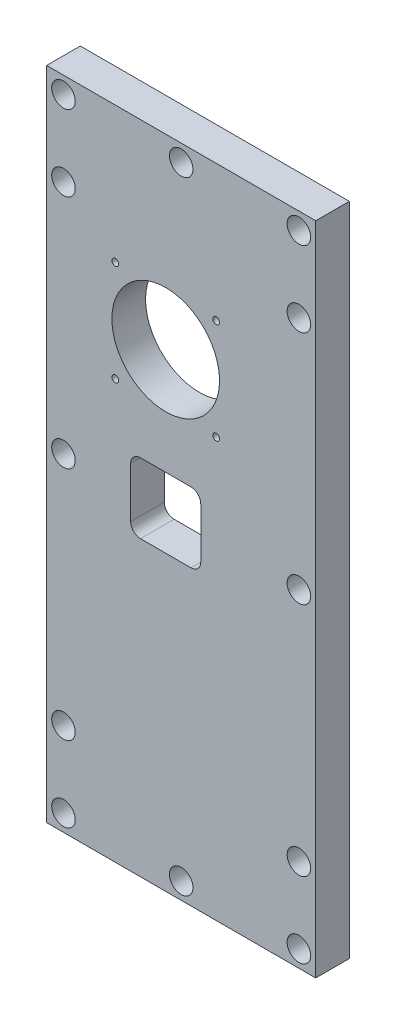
ISO-10303-21;
HEADER;
FILE_DESCRIPTION(('STEP AP214'),'2;1');
FILE_NAME('part.step','',(''),(''),'','','');
FILE_SCHEMA(('AUTOMOTIVE_DESIGN { 1 0 10303 214 1 1 1 1 }'));
ENDSEC;
DATA;
#1=APPLICATION_CONTEXT('core data for automotive mechanical design processes');
#2=APPLICATION_PROTOCOL_DEFINITION('international standard','automotive_design',2000,#1);
#3=PRODUCT_CONTEXT('',#1,'mechanical');
#4=PRODUCT('Part','Part','',(#3));
#5=PRODUCT_RELATED_PRODUCT_CATEGORY('part','',(#4));
#6=PRODUCT_DEFINITION_FORMATION('','',#4);
#7=PRODUCT_DEFINITION_CONTEXT('part definition',#1,'design');
#8=PRODUCT_DEFINITION('design','',#6,#7);
#9=PRODUCT_DEFINITION_SHAPE('','',#8);
#10=(LENGTH_UNIT() NAMED_UNIT(*) SI_UNIT(.MILLI.,.METRE.));
#11=(NAMED_UNIT(*) PLANE_ANGLE_UNIT() SI_UNIT($,.RADIAN.));
#12=(NAMED_UNIT(*) SI_UNIT($,.STERADIAN.) SOLID_ANGLE_UNIT());
#13=UNCERTAINTY_MEASURE_WITH_UNIT(LENGTH_MEASURE(1.E-05),#10,'distance_accuracy_value','');
#14=(GEOMETRIC_REPRESENTATION_CONTEXT(3) GLOBAL_UNCERTAINTY_ASSIGNED_CONTEXT((#13)) GLOBAL_UNIT_ASSIGNED_CONTEXT((#10,
#11,#12)) REPRESENTATION_CONTEXT('',''));
#15=CARTESIAN_POINT('',(0.,0.,0.));
#16=DIRECTION('',(0.,0.,1.));
#17=DIRECTION('',(1.,0.,0.));
#18=AXIS2_PLACEMENT_3D('',#15,#16,#17);
#19=CARTESIAN_POINT('',(-69.0593853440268,70.0995316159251,-10.));
#20=DIRECTION('',(-1.,0.,0.));
#21=DIRECTION('',(0.,0.,1.));
#22=AXIS2_PLACEMENT_3D('',#19,#20,#21);
#23=PLANE('',#22);
#24=DIRECTION('',(0.,-1.,0.));
#25=VECTOR('',#24,1.);
#26=CARTESIAN_POINT('',(-69.0593853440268,70.0995316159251,0.));
#27=LINE('',#26,#25);
#28=CARTESIAN_POINT('',(-69.0593853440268,70.0995316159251,0.));
#29=VERTEX_POINT('',#28);
#30=CARTESIAN_POINT('',(-69.0593853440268,-124.900468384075,0.));
#31=VERTEX_POINT('',#30);
#32=EDGE_CURVE('E183',#29,#31,#27,.T.);
#33=ORIENTED_EDGE('',*,*,#32,.F.);
#34=DIRECTION('',(0.,0.,1.));
#35=VECTOR('',#34,1.);
#36=CARTESIAN_POINT('',(-69.0593853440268,70.0995316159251,-10.));
#37=LINE('',#36,#35);
#38=CARTESIAN_POINT('',(-69.0593853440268,70.0995316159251,-10.));
#39=VERTEX_POINT('',#38);
#40=EDGE_CURVE('E11',#39,#29,#37,.T.);
#41=ORIENTED_EDGE('',*,*,#40,.F.);
#42=DIRECTION('',(0.,-1.,0.));
#43=VECTOR('',#42,1.);
#44=CARTESIAN_POINT('',(-69.0593853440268,70.0995316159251,-10.));
#45=LINE('',#44,#43);
#46=CARTESIAN_POINT('',(-69.0593853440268,-124.900468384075,-10.));
#47=VERTEX_POINT('',#46);
#48=EDGE_CURVE('E224',#39,#47,#45,.T.);
#49=ORIENTED_EDGE('',*,*,#48,.T.);
#50=DIRECTION('',(0.,0.,1.));
#51=VECTOR('',#50,1.);
#52=CARTESIAN_POINT('',(-69.0593853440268,-124.900468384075,-10.));
#53=LINE('',#52,#51);
#54=EDGE_CURVE('E36',#47,#31,#53,.T.);
#55=ORIENTED_EDGE('',*,*,#54,.T.);
#56=EDGE_LOOP('',(#33,#41,#49,#55));
#57=FACE_BOUND('',#56,.T.);
#58=ADVANCED_FACE('F33',(#57),#23,.T.);
#59=CARTESIAN_POINT('',(-69.0593853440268,70.0995316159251,-10.));
#60=DIRECTION('',(0.,1.,0.));
#61=DIRECTION('',(0.,0.,1.));
#62=AXIS2_PLACEMENT_3D('',#59,#60,#61);
#63=PLANE('',#62);
#64=DIRECTION('',(-1.,0.,0.));
#65=VECTOR('',#64,1.);
#66=CARTESIAN_POINT('',(-69.0593853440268,70.0995316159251,0.));
#67=LINE('',#66,#65);
#68=CARTESIAN_POINT('',(10.9406146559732,70.0995316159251,0.));
#69=VERTEX_POINT('',#68);
#70=EDGE_CURVE('E228',#69,#29,#67,.T.);
#71=ORIENTED_EDGE('',*,*,#70,.F.);
#72=DIRECTION('',(0.,0.,1.));
#73=VECTOR('',#72,1.);
#74=CARTESIAN_POINT('',(10.9406146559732,70.0995316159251,-10.));
#75=LINE('',#74,#73);
#76=CARTESIAN_POINT('',(10.9406146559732,70.0995316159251,-10.));
#77=VERTEX_POINT('',#76);
#78=EDGE_CURVE('E41',#77,#69,#75,.T.);
#79=ORIENTED_EDGE('',*,*,#78,.F.);
#80=DIRECTION('',(-1.,0.,0.));
#81=VECTOR('',#80,1.);
#82=CARTESIAN_POINT('',(-69.0593853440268,70.0995316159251,-10.));
#83=LINE('',#82,#81);
#84=EDGE_CURVE('E234',#77,#39,#83,.T.);
#85=ORIENTED_EDGE('',*,*,#84,.T.);
#86=ORIENTED_EDGE('',*,*,#40,.T.);
#87=EDGE_LOOP('',(#71,#79,#85,#86));
#88=FACE_BOUND('',#87,.T.);
#89=ADVANCED_FACE('F259',(#88),#63,.T.);
#90=CARTESIAN_POINT('',(10.9406146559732,70.0995316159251,-10.));
#91=DIRECTION('',(1.,0.,0.));
#92=DIRECTION('',(0.,1.,0.));
#93=AXIS2_PLACEMENT_3D('',#90,#91,#92);
#94=PLANE('',#93);
#95=DIRECTION('',(0.,1.,0.));
#96=VECTOR('',#95,1.);
#97=CARTESIAN_POINT('',(10.9406146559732,70.0995316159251,0.));
#98=LINE('',#97,#96);
#99=CARTESIAN_POINT('',(10.9406146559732,-124.900468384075,0.));
#100=VERTEX_POINT('',#99);
#101=EDGE_CURVE('E242',#100,#69,#98,.T.);
#102=ORIENTED_EDGE('',*,*,#101,.F.);
#103=DIRECTION('',(0.,0.,1.));
#104=VECTOR('',#103,1.);
#105=CARTESIAN_POINT('',(10.9406146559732,-124.900468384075,-10.));
#106=LINE('',#105,#104);
#107=CARTESIAN_POINT('',(10.9406146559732,-124.900468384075,-10.));
#108=VERTEX_POINT('',#107);
#109=EDGE_CURVE('E247',#108,#100,#106,.T.);
#110=ORIENTED_EDGE('',*,*,#109,.F.);
#111=DIRECTION('',(0.,1.,0.));
#112=VECTOR('',#111,1.);
#113=CARTESIAN_POINT('',(10.9406146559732,70.0995316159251,-10.));
#114=LINE('',#113,#112);
#115=EDGE_CURVE('E231',#108,#77,#114,.T.);
#116=ORIENTED_EDGE('',*,*,#115,.T.);
#117=ORIENTED_EDGE('',*,*,#78,.T.);
#118=EDGE_LOOP('',(#102,#110,#116,#117));
#119=FACE_BOUND('',#118,.T.);
#120=ADVANCED_FACE('F265',(#119),#94,.T.);
#121=CARTESIAN_POINT('',(-69.0593853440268,-124.900468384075,-10.));
#122=DIRECTION('',(0.,-1.,0.));
#123=DIRECTION('',(1.,0.,0.));
#124=AXIS2_PLACEMENT_3D('',#121,#122,#123);
#125=PLANE('',#124);
#126=DIRECTION('',(1.,0.,0.));
#127=VECTOR('',#126,1.);
#128=CARTESIAN_POINT('',(-69.0593853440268,-124.900468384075,0.));
#129=LINE('',#128,#127);
#130=EDGE_CURVE('E239',#31,#100,#129,.T.);
#131=ORIENTED_EDGE('',*,*,#130,.F.);
#132=ORIENTED_EDGE('',*,*,#54,.F.);
#133=DIRECTION('',(1.,0.,0.));
#134=VECTOR('',#133,1.);
#135=CARTESIAN_POINT('',(-69.0593853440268,-124.900468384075,-10.));
#136=LINE('',#135,#134);
#137=EDGE_CURVE('E227',#47,#108,#136,.T.);
#138=ORIENTED_EDGE('',*,*,#137,.T.);
#139=ORIENTED_EDGE('',*,*,#109,.T.);
#140=EDGE_LOOP('',(#131,#132,#138,#139));
#141=FACE_BOUND('',#140,.T.);
#142=ADVANCED_FACE('F255',(#141),#125,.T.);
#143=CARTESIAN_POINT('',(0.,0.,-10.));
#144=DIRECTION('',(0.,0.,1.));
#145=DIRECTION('',(1.,0.,0.));
#146=AXIS2_PLACEMENT_3D('',#143,#144,#145);
#147=PLANE('',#146);
#148=CARTESIAN_POINT('',(-64.0593853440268,65.0995316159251,-10.));
#149=DIRECTION('',(0.,0.,-1.));
#150=DIRECTION('',(-1.,0.,0.));
#151=AXIS2_PLACEMENT_3D('',#148,#149,#150);
#152=CIRCLE('',#151,1.7);
#153=CARTESIAN_POINT('',(-65.7593853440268,65.0995316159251,-10.));
#154=VERTEX_POINT('',#153);
#155=EDGE_CURVE('E869',#154,#154,#152,.T.);
#156=ORIENTED_EDGE('',*,*,#155,.F.);
#157=EDGE_LOOP('',(#156));
#158=FACE_BOUND('',#157,.T.);
#159=CARTESIAN_POINT('',(-29.0593853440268,65.099531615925,-10.));
#160=DIRECTION('',(0.,0.,-1.));
#161=DIRECTION('',(-1.,0.,0.));
#162=AXIS2_PLACEMENT_3D('',#159,#160,#161);
#163=CIRCLE('',#162,1.7);
#164=CARTESIAN_POINT('',(-30.7593853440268,65.099531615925,-10.));
#165=VERTEX_POINT('',#164);
#166=EDGE_CURVE('E872',#165,#165,#163,.T.);
#167=ORIENTED_EDGE('',*,*,#166,.F.);
#168=EDGE_LOOP('',(#167));
#169=FACE_BOUND('',#168,.T.);
#170=CARTESIAN_POINT('',(-64.0593853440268,42.5995316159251,-10.));
#171=DIRECTION('',(0.,0.,-1.));
#172=DIRECTION('',(-1.,0.,0.));
#173=AXIS2_PLACEMENT_3D('',#170,#171,#172);
#174=CIRCLE('',#173,1.7);
#175=CARTESIAN_POINT('',(-65.7593853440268,42.5995316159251,-10.));
#176=VERTEX_POINT('',#175);
#177=EDGE_CURVE('E878',#176,#176,#174,.T.);
#178=ORIENTED_EDGE('',*,*,#177,.F.);
#179=EDGE_LOOP('',(#178));
#180=FACE_BOUND('',#179,.T.);
#181=CARTESIAN_POINT('',(-64.0593853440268,-27.4004683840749,-10.));
#182=DIRECTION('',(0.,0.,-1.));
#183=DIRECTION('',(-1.,0.,0.));
#184=AXIS2_PLACEMENT_3D('',#181,#182,#183);
#185=CIRCLE('',#184,1.7);
#186=CARTESIAN_POINT('',(-65.7593853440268,-27.4004683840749,-10.));
#187=VERTEX_POINT('',#186);
#188=EDGE_CURVE('E884',#187,#187,#185,.T.);
#189=ORIENTED_EDGE('',*,*,#188,.F.);
#190=EDGE_LOOP('',(#189));
#191=FACE_BOUND('',#190,.T.);
#192=CARTESIAN_POINT('',(-64.0593853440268,-97.4004683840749,-10.));
#193=DIRECTION('',(0.,0.,-1.));
#194=DIRECTION('',(-1.,0.,0.));
#195=AXIS2_PLACEMENT_3D('',#192,#193,#194);
#196=CIRCLE('',#195,1.7);
#197=CARTESIAN_POINT('',(-65.7593853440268,-97.4004683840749,-10.));
#198=VERTEX_POINT('',#197);
#199=EDGE_CURVE('E890',#198,#198,#196,.T.);
#200=ORIENTED_EDGE('',*,*,#199,.F.);
#201=EDGE_LOOP('',(#200));
#202=FACE_BOUND('',#201,.T.);
#203=CARTESIAN_POINT('',(-64.0593853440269,-119.900468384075,-10.));
#204=DIRECTION('',(0.,0.,-1.));
#205=DIRECTION('',(-1.,0.,0.));
#206=AXIS2_PLACEMENT_3D('',#203,#204,#205);
#207=CIRCLE('',#206,1.7);
#208=CARTESIAN_POINT('',(-65.7593853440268,-119.900468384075,-10.));
#209=VERTEX_POINT('',#208);
#210=EDGE_CURVE('E896',#209,#209,#207,.T.);
#211=ORIENTED_EDGE('',*,*,#210,.F.);
#212=EDGE_LOOP('',(#211));
#213=FACE_BOUND('',#212,.T.);
#214=CARTESIAN_POINT('',(-29.0593853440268,-119.900468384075,-10.));
#215=DIRECTION('',(0.,0.,-1.));
#216=DIRECTION('',(-1.,0.,0.));
#217=AXIS2_PLACEMENT_3D('',#214,#215,#216);
#218=CIRCLE('',#217,1.7);
#219=CARTESIAN_POINT('',(-30.7593853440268,-119.900468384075,-10.));
#220=VERTEX_POINT('',#219);
#221=EDGE_CURVE('E902',#220,#220,#218,.T.);
#222=ORIENTED_EDGE('',*,*,#221,.F.);
#223=EDGE_LOOP('',(#222));
#224=FACE_BOUND('',#223,.T.);
#225=CARTESIAN_POINT('',(5.94061465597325,-119.900468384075,-10.));
#226=DIRECTION('',(0.,0.,-1.));
#227=DIRECTION('',(-1.,0.,0.));
#228=AXIS2_PLACEMENT_3D('',#225,#226,#227);
#229=CIRCLE('',#228,1.7);
#230=CARTESIAN_POINT('',(4.24061465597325,-119.900468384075,-10.));
#231=VERTEX_POINT('',#230);
#232=EDGE_CURVE('E853',#231,#231,#229,.T.);
#233=ORIENTED_EDGE('',*,*,#232,.F.);
#234=EDGE_LOOP('',(#233));
#235=FACE_BOUND('',#234,.T.);
#236=CARTESIAN_POINT('',(5.94061465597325,-97.400468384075,-10.));
#237=DIRECTION('',(0.,0.,-1.));
#238=DIRECTION('',(-1.,0.,0.));
#239=AXIS2_PLACEMENT_3D('',#236,#237,#238);
#240=CIRCLE('',#239,1.7);
#241=CARTESIAN_POINT('',(4.24061465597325,-97.400468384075,-10.));
#242=VERTEX_POINT('',#241);
#243=EDGE_CURVE('E850',#242,#242,#240,.T.);
#244=ORIENTED_EDGE('',*,*,#243,.F.);
#245=EDGE_LOOP('',(#244));
#246=FACE_BOUND('',#245,.T.);
#247=CARTESIAN_POINT('',(5.94061465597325,-27.400468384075,-10.));
#248=DIRECTION('',(0.,0.,-1.));
#249=DIRECTION('',(-1.,0.,0.));
#250=AXIS2_PLACEMENT_3D('',#247,#248,#249);
#251=CIRCLE('',#250,1.7);
#252=CARTESIAN_POINT('',(4.24061465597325,-27.400468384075,-10.));
#253=VERTEX_POINT('',#252);
#254=EDGE_CURVE('E854',#253,#253,#251,.T.);
#255=ORIENTED_EDGE('',*,*,#254,.F.);
#256=EDGE_LOOP('',(#255));
#257=FACE_BOUND('',#256,.T.);
#258=CARTESIAN_POINT('',(5.94061465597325,42.5995316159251,-10.));
#259=DIRECTION('',(0.,0.,-1.));
#260=DIRECTION('',(-1.,0.,0.));
#261=AXIS2_PLACEMENT_3D('',#258,#259,#260);
#262=CIRCLE('',#261,1.7);
#263=CARTESIAN_POINT('',(4.24061465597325,42.5995316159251,-10.));
#264=VERTEX_POINT('',#263);
#265=EDGE_CURVE('E860',#264,#264,#262,.T.);
#266=ORIENTED_EDGE('',*,*,#265,.F.);
#267=EDGE_LOOP('',(#266));
#268=FACE_BOUND('',#267,.T.);
#269=CARTESIAN_POINT('',(5.94061465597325,65.099531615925,-10.));
#270=DIRECTION('',(0.,0.,-1.));
#271=DIRECTION('',(-1.,0.,0.));
#272=AXIS2_PLACEMENT_3D('',#269,#270,#271);
#273=CIRCLE('',#272,1.7);
#274=CARTESIAN_POINT('',(4.24061465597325,65.099531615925,-10.));
#275=VERTEX_POINT('',#274);
#276=EDGE_CURVE('E147',#275,#275,#273,.T.);
#277=ORIENTED_EDGE('',*,*,#276,.F.);
#278=EDGE_LOOP('',(#277));
#279=FACE_BOUND('',#278,.T.);
#280=DIRECTION('',(0.,-1.,0.));
#281=VECTOR('',#280,1.);
#282=CARTESIAN_POINT('',(-23.2413276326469,-19.9004683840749,-10.));
#283=LINE('',#282,#281);
#284=CARTESIAN_POINT('',(-23.2413276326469,-19.9004683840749,-10.));
#285=VERTEX_POINT('',#284);
#286=CARTESIAN_POINT('',(-23.2413276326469,-34.9004683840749,-10.));
#287=VERTEX_POINT('',#286);
#288=EDGE_CURVE('E164',#285,#287,#283,.T.);
#289=ORIENTED_EDGE('',*,*,#288,.F.);
#290=CARTESIAN_POINT('',(-26.1593853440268,-19.9004683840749,-10.));
#291=DIRECTION('',(0.,0.,-1.));
#292=DIRECTION('',(1.,0.,0.));
#293=AXIS2_PLACEMENT_3D('',#290,#291,#292);
#294=CIRCLE('',#293,2.91805771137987);
#295=CARTESIAN_POINT('',(-26.1593853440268,-16.9824106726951,-10.));
#296=VERTEX_POINT('',#295);
#297=EDGE_CURVE('E49',#296,#285,#294,.T.);
#298=ORIENTED_EDGE('',*,*,#297,.F.);
#299=DIRECTION('',(1.,0.,0.));
#300=VECTOR('',#299,1.);
#301=CARTESIAN_POINT('',(-26.1593853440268,-16.9824106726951,-10.));
#302=LINE('',#301,#300);
#303=CARTESIAN_POINT('',(-41.1593853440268,-16.9824106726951,-10.));
#304=VERTEX_POINT('',#303);
#305=EDGE_CURVE('E141',#304,#296,#302,.T.);
#306=ORIENTED_EDGE('',*,*,#305,.F.);
#307=CARTESIAN_POINT('',(-41.1593853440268,-19.9004683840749,-10.));
#308=DIRECTION('',(0.,0.,-1.));
#309=DIRECTION('',(1.,0.,0.));
#310=AXIS2_PLACEMENT_3D('',#307,#308,#309);
#311=CIRCLE('',#310,2.91805771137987);
#312=CARTESIAN_POINT('',(-44.0774430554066,-19.9004683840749,-10.));
#313=VERTEX_POINT('',#312);
#314=EDGE_CURVE('E144',#313,#304,#311,.T.);
#315=ORIENTED_EDGE('',*,*,#314,.F.);
#316=DIRECTION('',(0.,1.,0.));
#317=VECTOR('',#316,1.);
#318=CARTESIAN_POINT('',(-44.0774430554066,-19.9004683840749,-10.));
#319=LINE('',#318,#317);
#320=CARTESIAN_POINT('',(-44.0774430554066,-34.9004683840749,-10.));
#321=VERTEX_POINT('',#320);
#322=EDGE_CURVE('E176',#321,#313,#319,.T.);
#323=ORIENTED_EDGE('',*,*,#322,.F.);
#324=CARTESIAN_POINT('',(-41.1593853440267,-34.9004683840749,-10.));
#325=DIRECTION('',(0.,0.,-1.));
#326=DIRECTION('',(1.,0.,0.));
#327=AXIS2_PLACEMENT_3D('',#324,#325,#326);
#328=CIRCLE('',#327,2.91805771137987);
#329=CARTESIAN_POINT('',(-41.1593853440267,-37.8185260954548,-10.));
#330=VERTEX_POINT('',#329);
#331=EDGE_CURVE('E173',#330,#321,#328,.T.);
#332=ORIENTED_EDGE('',*,*,#331,.F.);
#333=DIRECTION('',(-1.,0.,0.));
#334=VECTOR('',#333,1.);
#335=CARTESIAN_POINT('',(-41.1593853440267,-37.8185260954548,-10.));
#336=LINE('',#335,#334);
#337=CARTESIAN_POINT('',(-26.1593853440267,-37.8185260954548,-10.));
#338=VERTEX_POINT('',#337);
#339=EDGE_CURVE('E170',#338,#330,#336,.T.);
#340=ORIENTED_EDGE('',*,*,#339,.F.);
#341=CARTESIAN_POINT('',(-26.1593853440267,-34.9004683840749,-10.));
#342=DIRECTION('',(0.,0.,-1.));
#343=DIRECTION('',(1.,0.,0.));
#344=AXIS2_PLACEMENT_3D('',#341,#342,#343);
#345=CIRCLE('',#344,2.91805771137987);
#346=EDGE_CURVE('E167',#287,#338,#345,.T.);
#347=ORIENTED_EDGE('',*,*,#346,.F.);
#348=EDGE_LOOP('',(#289,#298,#306,#315,#323,#332,#340,#347));
#349=FACE_BOUND('',#348,.T.);
#350=CARTESIAN_POINT('',(-33.6593853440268,14.5995316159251,-10.));
#351=DIRECTION('',(0.,0.,-1.));
#352=DIRECTION('',(-1.,0.,0.));
#353=AXIS2_PLACEMENT_3D('',#350,#351,#352);
#354=CIRCLE('',#353,16.);
#355=CARTESIAN_POINT('',(-49.6593853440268,14.5995316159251,-10.));
#356=VERTEX_POINT('',#355);
#357=EDGE_CURVE('E199',#356,#356,#354,.T.);
#358=ORIENTED_EDGE('',*,*,#357,.F.);
#359=EDGE_LOOP('',(#358));
#360=FACE_BOUND('',#359,.T.);
#361=CARTESIAN_POINT('',(-48.6593853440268,-0.40046838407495,-10.));
#362=DIRECTION('',(0.,0.,-1.));
#363=DIRECTION('',(-1.,0.,0.));
#364=AXIS2_PLACEMENT_3D('',#361,#362,#363);
#365=CIRCLE('',#364,0.999999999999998);
#366=CARTESIAN_POINT('',(-49.6593853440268,-0.40046838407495,-10.));
#367=VERTEX_POINT('',#366);
#368=EDGE_CURVE('E198',#367,#367,#365,.T.);
#369=ORIENTED_EDGE('',*,*,#368,.F.);
#370=EDGE_LOOP('',(#369));
#371=FACE_BOUND('',#370,.T.);
#372=CARTESIAN_POINT('',(-18.6593853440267,-0.400468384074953,-10.));
#373=DIRECTION('',(0.,0.,-1.));
#374=DIRECTION('',(-1.,0.,0.));
#375=AXIS2_PLACEMENT_3D('',#372,#373,#374);
#376=CIRCLE('',#375,1.);
#377=CARTESIAN_POINT('',(-19.6593853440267,-0.400468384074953,-10.));
#378=VERTEX_POINT('',#377);
#379=EDGE_CURVE('E216',#378,#378,#376,.T.);
#380=ORIENTED_EDGE('',*,*,#379,.F.);
#381=EDGE_LOOP('',(#380));
#382=FACE_BOUND('',#381,.T.);
#383=CARTESIAN_POINT('',(-48.6593853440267,29.599531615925,-10.));
#384=DIRECTION('',(0.,0.,-1.));
#385=DIRECTION('',(-1.,0.,0.));
#386=AXIS2_PLACEMENT_3D('',#383,#384,#385);
#387=CIRCLE('',#386,0.999999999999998);
#388=CARTESIAN_POINT('',(-49.6593853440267,29.599531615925,-10.));
#389=VERTEX_POINT('',#388);
#390=EDGE_CURVE('E210',#389,#389,#387,.T.);
#391=ORIENTED_EDGE('',*,*,#390,.F.);
#392=EDGE_LOOP('',(#391));
#393=FACE_BOUND('',#392,.T.);
#394=CARTESIAN_POINT('',(-18.6593853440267,29.599531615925,-10.));
#395=DIRECTION('',(0.,0.,-1.));
#396=DIRECTION('',(-1.,0.,0.));
#397=AXIS2_PLACEMENT_3D('',#394,#395,#396);
#398=CIRCLE('',#397,1.);
#399=CARTESIAN_POINT('',(-19.6593853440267,29.599531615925,-10.));
#400=VERTEX_POINT('',#399);
#401=EDGE_CURVE('E204',#400,#400,#398,.T.);
#402=ORIENTED_EDGE('',*,*,#401,.F.);
#403=EDGE_LOOP('',(#402));
#404=FACE_BOUND('',#403,.T.);
#405=ORIENTED_EDGE('',*,*,#48,.F.);
#406=ORIENTED_EDGE('',*,*,#84,.F.);
#407=ORIENTED_EDGE('',*,*,#115,.F.);
#408=ORIENTED_EDGE('',*,*,#137,.F.);
#409=EDGE_LOOP('',(#405,#406,#407,#408));
#410=FACE_BOUND('',#409,.T.);
#411=ADVANCED_FACE('F262',(#158,#169,#180,#191,#202,#213,#224,#235,#246,#257,#268,#279,#349,
#360,#371,#382,#393,#404,#410),#147,.F.);
#412=CARTESIAN_POINT('',(0.,0.,0.));
#413=DIRECTION('',(0.,0.,1.));
#414=DIRECTION('',(1.,0.,0.));
#415=AXIS2_PLACEMENT_3D('',#412,#413,#414);
#416=PLANE('',#415);
#417=CARTESIAN_POINT('',(-64.0593853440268,-27.4004683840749,0.));
#418=DIRECTION('',(0.,0.,1.));
#419=DIRECTION('',(1.,0.,0.));
#420=AXIS2_PLACEMENT_3D('',#417,#418,#419);
#421=CIRCLE('',#420,3.5);
#422=CARTESIAN_POINT('',(-60.5593853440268,-27.4004683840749,0.));
#423=VERTEX_POINT('',#422);
#424=EDGE_CURVE('E803',#423,#423,#421,.T.);
#425=ORIENTED_EDGE('',*,*,#424,.F.);
#426=EDGE_LOOP('',(#425));
#427=FACE_BOUND('',#426,.T.);
#428=CARTESIAN_POINT('',(-64.0593853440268,-97.4004683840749,0.));
#429=DIRECTION('',(0.,0.,1.));
#430=DIRECTION('',(1.,0.,0.));
#431=AXIS2_PLACEMENT_3D('',#428,#429,#430);
#432=CIRCLE('',#431,3.5);
#433=CARTESIAN_POINT('',(-60.5593853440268,-97.4004683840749,0.));
#434=VERTEX_POINT('',#433);
#435=EDGE_CURVE('E806',#434,#434,#432,.T.);
#436=ORIENTED_EDGE('',*,*,#435,.F.);
#437=EDGE_LOOP('',(#436));
#438=FACE_BOUND('',#437,.T.);
#439=CARTESIAN_POINT('',(-64.0593853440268,-119.900468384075,0.));
#440=DIRECTION('',(0.,0.,1.));
#441=DIRECTION('',(1.,0.,0.));
#442=AXIS2_PLACEMENT_3D('',#439,#440,#441);
#443=CIRCLE('',#442,3.5);
#444=CARTESIAN_POINT('',(-60.5593853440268,-119.900468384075,0.));
#445=VERTEX_POINT('',#444);
#446=EDGE_CURVE('E1016',#445,#445,#443,.T.);
#447=ORIENTED_EDGE('',*,*,#446,.F.);
#448=EDGE_LOOP('',(#447));
#449=FACE_BOUND('',#448,.T.);
#450=CARTESIAN_POINT('',(5.94061465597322,-119.900468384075,0.));
#451=DIRECTION('',(0.,0.,1.));
#452=DIRECTION('',(1.,0.,0.));
#453=AXIS2_PLACEMENT_3D('',#450,#451,#452);
#454=CIRCLE('',#453,3.5);
#455=CARTESIAN_POINT('',(9.44061465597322,-119.900468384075,0.));
#456=VERTEX_POINT('',#455);
#457=EDGE_CURVE('E1004',#456,#456,#454,.T.);
#458=ORIENTED_EDGE('',*,*,#457,.F.);
#459=EDGE_LOOP('',(#458));
#460=FACE_BOUND('',#459,.T.);
#461=CARTESIAN_POINT('',(5.94061465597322,-97.4004683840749,0.));
#462=DIRECTION('',(0.,0.,1.));
#463=DIRECTION('',(1.,0.,0.));
#464=AXIS2_PLACEMENT_3D('',#461,#462,#463);
#465=CIRCLE('',#464,3.5);
#466=CARTESIAN_POINT('',(9.44061465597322,-97.4004683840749,0.));
#467=VERTEX_POINT('',#466);
#468=EDGE_CURVE('E835',#467,#467,#465,.T.);
#469=ORIENTED_EDGE('',*,*,#468,.F.);
#470=EDGE_LOOP('',(#469));
#471=FACE_BOUND('',#470,.T.);
#472=CARTESIAN_POINT('',(5.94061465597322,-27.4004683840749,0.));
#473=DIRECTION('',(0.,0.,1.));
#474=DIRECTION('',(1.,0.,0.));
#475=AXIS2_PLACEMENT_3D('',#472,#473,#474);
#476=CIRCLE('',#475,3.5);
#477=CARTESIAN_POINT('',(9.44061465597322,-27.4004683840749,0.));
#478=VERTEX_POINT('',#477);
#479=EDGE_CURVE('E829',#478,#478,#476,.T.);
#480=ORIENTED_EDGE('',*,*,#479,.F.);
#481=EDGE_LOOP('',(#480));
#482=FACE_BOUND('',#481,.T.);
#483=CARTESIAN_POINT('',(5.94061465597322,42.5995316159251,0.));
#484=DIRECTION('',(0.,0.,1.));
#485=DIRECTION('',(1.,0.,0.));
#486=AXIS2_PLACEMENT_3D('',#483,#484,#485);
#487=CIRCLE('',#486,3.5);
#488=CARTESIAN_POINT('',(9.44061465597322,42.5995316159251,0.));
#489=VERTEX_POINT('',#488);
#490=EDGE_CURVE('E823',#489,#489,#487,.T.);
#491=ORIENTED_EDGE('',*,*,#490,.F.);
#492=EDGE_LOOP('',(#491));
#493=FACE_BOUND('',#492,.T.);
#494=CARTESIAN_POINT('',(-64.0593853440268,65.099531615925,0.));
#495=DIRECTION('',(0.,0.,1.));
#496=DIRECTION('',(1.,0.,0.));
#497=AXIS2_PLACEMENT_3D('',#494,#495,#496);
#498=CIRCLE('',#497,3.5);
#499=CARTESIAN_POINT('',(-60.5593853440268,65.099531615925,0.));
#500=VERTEX_POINT('',#499);
#501=EDGE_CURVE('E817',#500,#500,#498,.T.);
#502=ORIENTED_EDGE('',*,*,#501,.F.);
#503=EDGE_LOOP('',(#502));
#504=FACE_BOUND('',#503,.T.);
#505=CARTESIAN_POINT('',(-64.0593853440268,42.5995316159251,0.));
#506=DIRECTION('',(0.,0.,1.));
#507=DIRECTION('',(1.,0.,0.));
#508=AXIS2_PLACEMENT_3D('',#505,#506,#507);
#509=CIRCLE('',#508,3.5);
#510=CARTESIAN_POINT('',(-60.5593853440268,42.5995316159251,0.));
#511=VERTEX_POINT('',#510);
#512=EDGE_CURVE('E809',#511,#511,#509,.T.);
#513=ORIENTED_EDGE('',*,*,#512,.F.);
#514=EDGE_LOOP('',(#513));
#515=FACE_BOUND('',#514,.T.);
#516=CARTESIAN_POINT('',(-29.0593853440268,-119.900468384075,0.));
#517=DIRECTION('',(0.,0.,1.));
#518=DIRECTION('',(1.,0.,0.));
#519=AXIS2_PLACEMENT_3D('',#516,#517,#518);
#520=CIRCLE('',#519,3.5);
#521=CARTESIAN_POINT('',(-25.5593853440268,-119.900468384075,0.));
#522=VERTEX_POINT('',#521);
#523=EDGE_CURVE('E1043',#522,#522,#520,.T.);
#524=ORIENTED_EDGE('',*,*,#523,.F.);
#525=EDGE_LOOP('',(#524));
#526=FACE_BOUND('',#525,.T.);
#527=CARTESIAN_POINT('',(-29.0593853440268,65.099531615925,0.));
#528=DIRECTION('',(0.,0.,1.));
#529=DIRECTION('',(1.,0.,0.));
#530=AXIS2_PLACEMENT_3D('',#527,#528,#529);
#531=CIRCLE('',#530,3.5);
#532=CARTESIAN_POINT('',(-25.5593853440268,65.099531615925,0.));
#533=VERTEX_POINT('',#532);
#534=EDGE_CURVE('E1011',#533,#533,#531,.T.);
#535=ORIENTED_EDGE('',*,*,#534,.F.);
#536=EDGE_LOOP('',(#535));
#537=FACE_BOUND('',#536,.T.);
#538=CARTESIAN_POINT('',(5.94061465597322,65.099531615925,0.));
#539=DIRECTION('',(0.,0.,1.));
#540=DIRECTION('',(1.,0.,0.));
#541=AXIS2_PLACEMENT_3D('',#538,#539,#540);
#542=CIRCLE('',#541,3.5);
#543=CARTESIAN_POINT('',(9.44061465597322,65.099531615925,0.));
#544=VERTEX_POINT('',#543);
#545=EDGE_CURVE('E816',#544,#544,#542,.T.);
#546=ORIENTED_EDGE('',*,*,#545,.F.);
#547=EDGE_LOOP('',(#546));
#548=FACE_BOUND('',#547,.T.);
#549=CARTESIAN_POINT('',(-26.1593853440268,-19.9004683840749,0.));
#550=DIRECTION('',(0.,0.,-1.));
#551=DIRECTION('',(1.,0.,0.));
#552=AXIS2_PLACEMENT_3D('',#549,#550,#551);
#553=CIRCLE('',#552,2.91805771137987);
#554=CARTESIAN_POINT('',(-26.1593853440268,-16.9824106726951,0.));
#555=VERTEX_POINT('',#554);
#556=CARTESIAN_POINT('',(-23.2413276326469,-19.9004683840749,0.));
#557=VERTEX_POINT('',#556);
#558=EDGE_CURVE('E124',#555,#557,#553,.T.);
#559=ORIENTED_EDGE('',*,*,#558,.T.);
#560=DIRECTION('',(0.,-1.,0.));
#561=VECTOR('',#560,1.);
#562=CARTESIAN_POINT('',(-23.2413276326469,-19.9004683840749,0.));
#563=LINE('',#562,#561);
#564=CARTESIAN_POINT('',(-23.2413276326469,-34.9004683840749,0.));
#565=VERTEX_POINT('',#564);
#566=EDGE_CURVE('E133',#557,#565,#563,.T.);
#567=ORIENTED_EDGE('',*,*,#566,.T.);
#568=CARTESIAN_POINT('',(-26.1593853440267,-34.9004683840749,0.));
#569=DIRECTION('',(0.,0.,-1.));
#570=DIRECTION('',(1.,0.,0.));
#571=AXIS2_PLACEMENT_3D('',#568,#569,#570);
#572=CIRCLE('',#571,2.91805771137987);
#573=CARTESIAN_POINT('',(-26.1593853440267,-37.8185260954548,0.));
#574=VERTEX_POINT('',#573);
#575=EDGE_CURVE('E57',#565,#574,#572,.T.);
#576=ORIENTED_EDGE('',*,*,#575,.T.);
#577=DIRECTION('',(-1.,0.,0.));
#578=VECTOR('',#577,1.);
#579=CARTESIAN_POINT('',(-41.1593853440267,-37.8185260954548,0.));
#580=LINE('',#579,#578);
#581=CARTESIAN_POINT('',(-41.1593853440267,-37.8185260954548,0.));
#582=VERTEX_POINT('',#581);
#583=EDGE_CURVE('E151',#574,#582,#580,.T.);
#584=ORIENTED_EDGE('',*,*,#583,.T.);
#585=CARTESIAN_POINT('',(-41.1593853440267,-34.9004683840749,0.));
#586=DIRECTION('',(0.,0.,-1.));
#587=DIRECTION('',(1.,0.,0.));
#588=AXIS2_PLACEMENT_3D('',#585,#586,#587);
#589=CIRCLE('',#588,2.91805771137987);
#590=CARTESIAN_POINT('',(-44.0774430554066,-34.9004683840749,0.));
#591=VERTEX_POINT('',#590);
#592=EDGE_CURVE('E154',#582,#591,#589,.T.);
#593=ORIENTED_EDGE('',*,*,#592,.T.);
#594=DIRECTION('',(0.,1.,0.));
#595=VECTOR('',#594,1.);
#596=CARTESIAN_POINT('',(-44.0774430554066,-19.9004683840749,0.));
#597=LINE('',#596,#595);
#598=CARTESIAN_POINT('',(-44.0774430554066,-19.9004683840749,0.));
#599=VERTEX_POINT('',#598);
#600=EDGE_CURVE('E157',#591,#599,#597,.T.);
#601=ORIENTED_EDGE('',*,*,#600,.T.);
#602=CARTESIAN_POINT('',(-41.1593853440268,-19.9004683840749,0.));
#603=DIRECTION('',(0.,0.,-1.));
#604=DIRECTION('',(1.,0.,0.));
#605=AXIS2_PLACEMENT_3D('',#602,#603,#604);
#606=CIRCLE('',#605,2.91805771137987);
#607=CARTESIAN_POINT('',(-41.1593853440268,-16.9824106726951,0.));
#608=VERTEX_POINT('',#607);
#609=EDGE_CURVE('E160',#599,#608,#606,.T.);
#610=ORIENTED_EDGE('',*,*,#609,.T.);
#611=DIRECTION('',(1.,0.,0.));
#612=VECTOR('',#611,1.);
#613=CARTESIAN_POINT('',(-26.1593853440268,-16.9824106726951,0.));
#614=LINE('',#613,#612);
#615=EDGE_CURVE('E130',#608,#555,#614,.T.);
#616=ORIENTED_EDGE('',*,*,#615,.T.);
#617=EDGE_LOOP('',(#559,#567,#576,#584,#593,#601,#610,#616));
#618=FACE_BOUND('',#617,.T.);
#619=CARTESIAN_POINT('',(-33.6593853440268,14.5995316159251,0.));
#620=DIRECTION('',(0.,0.,-1.));
#621=DIRECTION('',(-1.,0.,0.));
#622=AXIS2_PLACEMENT_3D('',#619,#620,#621);
#623=CIRCLE('',#622,16.);
#624=CARTESIAN_POINT('',(-49.6593853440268,14.5995316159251,0.));
#625=VERTEX_POINT('',#624);
#626=EDGE_CURVE('E195',#625,#625,#623,.T.);
#627=ORIENTED_EDGE('',*,*,#626,.T.);
#628=EDGE_LOOP('',(#627));
#629=FACE_BOUND('',#628,.T.);
#630=CARTESIAN_POINT('',(-48.6593853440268,-0.40046838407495,0.));
#631=DIRECTION('',(0.,0.,-1.));
#632=DIRECTION('',(-1.,0.,0.));
#633=AXIS2_PLACEMENT_3D('',#630,#631,#632);
#634=CIRCLE('',#633,0.999999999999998);
#635=CARTESIAN_POINT('',(-49.6593853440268,-0.40046838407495,0.));
#636=VERTEX_POINT('',#635);
#637=EDGE_CURVE('E219',#636,#636,#634,.T.);
#638=ORIENTED_EDGE('',*,*,#637,.T.);
#639=EDGE_LOOP('',(#638));
#640=FACE_BOUND('',#639,.T.);
#641=CARTESIAN_POINT('',(-18.6593853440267,-0.400468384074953,0.));
#642=DIRECTION('',(0.,0.,-1.));
#643=DIRECTION('',(-1.,0.,0.));
#644=AXIS2_PLACEMENT_3D('',#641,#642,#643);
#645=CIRCLE('',#644,1.);
#646=CARTESIAN_POINT('',(-19.6593853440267,-0.400468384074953,0.));
#647=VERTEX_POINT('',#646);
#648=EDGE_CURVE('E213',#647,#647,#645,.T.);
#649=ORIENTED_EDGE('',*,*,#648,.T.);
#650=EDGE_LOOP('',(#649));
#651=FACE_BOUND('',#650,.T.);
#652=CARTESIAN_POINT('',(-48.6593853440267,29.599531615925,0.));
#653=DIRECTION('',(0.,0.,-1.));
#654=DIRECTION('',(-1.,0.,0.));
#655=AXIS2_PLACEMENT_3D('',#652,#653,#654);
#656=CIRCLE('',#655,0.999999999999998);
#657=CARTESIAN_POINT('',(-49.6593853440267,29.599531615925,0.));
#658=VERTEX_POINT('',#657);
#659=EDGE_CURVE('E207',#658,#658,#656,.T.);
#660=ORIENTED_EDGE('',*,*,#659,.T.);
#661=EDGE_LOOP('',(#660));
#662=FACE_BOUND('',#661,.T.);
#663=CARTESIAN_POINT('',(-18.6593853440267,29.599531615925,0.));
#664=DIRECTION('',(0.,0.,-1.));
#665=DIRECTION('',(-1.,0.,0.));
#666=AXIS2_PLACEMENT_3D('',#663,#664,#665);
#667=CIRCLE('',#666,1.);
#668=CARTESIAN_POINT('',(-19.6593853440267,29.599531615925,0.));
#669=VERTEX_POINT('',#668);
#670=EDGE_CURVE('E165',#669,#669,#667,.T.);
#671=ORIENTED_EDGE('',*,*,#670,.T.);
#672=EDGE_LOOP('',(#671));
#673=FACE_BOUND('',#672,.T.);
#674=ORIENTED_EDGE('',*,*,#32,.T.);
#675=ORIENTED_EDGE('',*,*,#130,.T.);
#676=ORIENTED_EDGE('',*,*,#101,.T.);
#677=ORIENTED_EDGE('',*,*,#70,.T.);
#678=EDGE_LOOP('',(#674,#675,#676,#677));
#679=FACE_BOUND('',#678,.T.);
#680=ADVANCED_FACE('F137',(#427,#438,#449,#460,#471,#482,#493,#504,#515,#526,#537,#548,#618,
#629,#640,#651,#662,#673,#679),#416,.T.);
#681=CARTESIAN_POINT('',(-18.6593853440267,29.599531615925,0.));
#682=DIRECTION('',(0.,0.,-1.));
#683=DIRECTION('',(-1.,0.,0.));
#684=AXIS2_PLACEMENT_3D('',#681,#682,#683);
#685=CYLINDRICAL_SURFACE('',#684,1.);
#686=ORIENTED_EDGE('',*,*,#670,.F.);
#687=EDGE_LOOP('',(#686));
#688=FACE_BOUND('',#687,.T.);
#689=ORIENTED_EDGE('',*,*,#401,.T.);
#690=EDGE_LOOP('',(#689));
#691=FACE_BOUND('',#690,.T.);
#692=ADVANCED_FACE('F297',(#688,#691),#685,.F.);
#693=CARTESIAN_POINT('',(-48.6593853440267,29.599531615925,0.));
#694=DIRECTION('',(0.,0.,-1.));
#695=DIRECTION('',(-1.,0.,0.));
#696=AXIS2_PLACEMENT_3D('',#693,#694,#695);
#697=CYLINDRICAL_SURFACE('',#696,0.999999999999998);
#698=ORIENTED_EDGE('',*,*,#659,.F.);
#699=EDGE_LOOP('',(#698));
#700=FACE_BOUND('',#699,.T.);
#701=ORIENTED_EDGE('',*,*,#390,.T.);
#702=EDGE_LOOP('',(#701));
#703=FACE_BOUND('',#702,.T.);
#704=ADVANCED_FACE('F302',(#700,#703),#697,.F.);
#705=CARTESIAN_POINT('',(-18.6593853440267,-0.400468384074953,0.));
#706=DIRECTION('',(0.,0.,-1.));
#707=DIRECTION('',(-1.,0.,0.));
#708=AXIS2_PLACEMENT_3D('',#705,#706,#707);
#709=CYLINDRICAL_SURFACE('',#708,1.);
#710=ORIENTED_EDGE('',*,*,#648,.F.);
#711=EDGE_LOOP('',(#710));
#712=FACE_BOUND('',#711,.T.);
#713=ORIENTED_EDGE('',*,*,#379,.T.);
#714=EDGE_LOOP('',(#713));
#715=FACE_BOUND('',#714,.T.);
#716=ADVANCED_FACE('F314',(#712,#715),#709,.F.);
#717=CARTESIAN_POINT('',(-48.6593853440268,-0.40046838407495,0.));
#718=DIRECTION('',(0.,0.,-1.));
#719=DIRECTION('',(-1.,0.,0.));
#720=AXIS2_PLACEMENT_3D('',#717,#718,#719);
#721=CYLINDRICAL_SURFACE('',#720,0.999999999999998);
#722=ORIENTED_EDGE('',*,*,#637,.F.);
#723=EDGE_LOOP('',(#722));
#724=FACE_BOUND('',#723,.T.);
#725=ORIENTED_EDGE('',*,*,#368,.T.);
#726=EDGE_LOOP('',(#725));
#727=FACE_BOUND('',#726,.T.);
#728=ADVANCED_FACE('F324',(#724,#727),#721,.F.);
#729=CARTESIAN_POINT('',(-33.6593853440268,14.5995316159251,0.));
#730=DIRECTION('',(0.,0.,-1.));
#731=DIRECTION('',(-1.,0.,0.));
#732=AXIS2_PLACEMENT_3D('',#729,#730,#731);
#733=CYLINDRICAL_SURFACE('',#732,16.);
#734=ORIENTED_EDGE('',*,*,#626,.F.);
#735=EDGE_LOOP('',(#734));
#736=FACE_BOUND('',#735,.T.);
#737=ORIENTED_EDGE('',*,*,#357,.T.);
#738=EDGE_LOOP('',(#737));
#739=FACE_BOUND('',#738,.T.);
#740=ADVANCED_FACE('F334',(#736,#739),#733,.F.);
#741=CARTESIAN_POINT('',(-26.1593853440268,-19.9004683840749,0.));
#742=DIRECTION('',(0.,0.,-1.));
#743=DIRECTION('',(-1.,0.,0.));
#744=AXIS2_PLACEMENT_3D('',#741,#742,#743);
#745=CYLINDRICAL_SURFACE('',#744,2.91805771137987);
#746=ORIENTED_EDGE('',*,*,#297,.T.);
#747=DIRECTION('',(0.,0.,-1.));
#748=VECTOR('',#747,1.);
#749=CARTESIAN_POINT('',(-23.2413276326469,-19.9004683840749,0.));
#750=LINE('',#749,#748);
#751=EDGE_CURVE('E120',#557,#285,#750,.T.);
#752=ORIENTED_EDGE('',*,*,#751,.F.);
#753=ORIENTED_EDGE('',*,*,#558,.F.);
#754=DIRECTION('',(0.,0.,-1.));
#755=VECTOR('',#754,1.);
#756=CARTESIAN_POINT('',(-26.1593853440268,-16.9824106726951,0.));
#757=LINE('',#756,#755);
#758=EDGE_CURVE('E181',#555,#296,#757,.T.);
#759=ORIENTED_EDGE('',*,*,#758,.T.);
#760=EDGE_LOOP('',(#746,#752,#753,#759));
#761=FACE_BOUND('',#760,.T.);
#762=ADVANCED_FACE('F122',(#761),#745,.F.);
#763=CARTESIAN_POINT('',(-26.1593853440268,-16.9824106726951,0.));
#764=DIRECTION('',(0.,1.,0.));
#765=DIRECTION('',(0.,0.,1.));
#766=AXIS2_PLACEMENT_3D('',#763,#764,#765);
#767=PLANE('',#766);
#768=ORIENTED_EDGE('',*,*,#305,.T.);
#769=ORIENTED_EDGE('',*,*,#758,.F.);
#770=ORIENTED_EDGE('',*,*,#615,.F.);
#771=DIRECTION('',(0.,0.,-1.));
#772=VECTOR('',#771,1.);
#773=CARTESIAN_POINT('',(-41.1593853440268,-16.9824106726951,0.));
#774=LINE('',#773,#772);
#775=EDGE_CURVE('E184',#608,#304,#774,.T.);
#776=ORIENTED_EDGE('',*,*,#775,.T.);
#777=EDGE_LOOP('',(#768,#769,#770,#776));
#778=FACE_BOUND('',#777,.T.);
#779=ADVANCED_FACE('F353',(#778),#767,.F.);
#780=CARTESIAN_POINT('',(-41.1593853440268,-19.9004683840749,0.));
#781=DIRECTION('',(0.,0.,-1.));
#782=DIRECTION('',(-1.,0.,0.));
#783=AXIS2_PLACEMENT_3D('',#780,#781,#782);
#784=CYLINDRICAL_SURFACE('',#783,2.91805771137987);
#785=ORIENTED_EDGE('',*,*,#314,.T.);
#786=ORIENTED_EDGE('',*,*,#775,.F.);
#787=ORIENTED_EDGE('',*,*,#609,.F.);
#788=DIRECTION('',(0.,0.,-1.));
#789=VECTOR('',#788,1.);
#790=CARTESIAN_POINT('',(-44.0774430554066,-19.9004683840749,0.));
#791=LINE('',#790,#789);
#792=EDGE_CURVE('E186',#599,#313,#791,.T.);
#793=ORIENTED_EDGE('',*,*,#792,.T.);
#794=EDGE_LOOP('',(#785,#786,#787,#793));
#795=FACE_BOUND('',#794,.T.);
#796=ADVANCED_FACE('F362',(#795),#784,.F.);
#797=CARTESIAN_POINT('',(-44.0774430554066,-19.9004683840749,0.));
#798=DIRECTION('',(-1.,0.,0.));
#799=DIRECTION('',(0.,-1.,0.));
#800=AXIS2_PLACEMENT_3D('',#797,#798,#799);
#801=PLANE('',#800);
#802=ORIENTED_EDGE('',*,*,#322,.T.);
#803=ORIENTED_EDGE('',*,*,#792,.F.);
#804=ORIENTED_EDGE('',*,*,#600,.F.);
#805=DIRECTION('',(0.,0.,-1.));
#806=VECTOR('',#805,1.);
#807=CARTESIAN_POINT('',(-44.0774430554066,-34.9004683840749,0.));
#808=LINE('',#807,#806);
#809=EDGE_CURVE('E188',#591,#321,#808,.T.);
#810=ORIENTED_EDGE('',*,*,#809,.T.);
#811=EDGE_LOOP('',(#802,#803,#804,#810));
#812=FACE_BOUND('',#811,.T.);
#813=ADVANCED_FACE('F372',(#812),#801,.F.);
#814=CARTESIAN_POINT('',(-41.1593853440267,-34.9004683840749,0.));
#815=DIRECTION('',(0.,0.,-1.));
#816=DIRECTION('',(-1.,0.,0.));
#817=AXIS2_PLACEMENT_3D('',#814,#815,#816);
#818=CYLINDRICAL_SURFACE('',#817,2.91805771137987);
#819=ORIENTED_EDGE('',*,*,#331,.T.);
#820=ORIENTED_EDGE('',*,*,#809,.F.);
#821=ORIENTED_EDGE('',*,*,#592,.F.);
#822=DIRECTION('',(0.,0.,-1.));
#823=VECTOR('',#822,1.);
#824=CARTESIAN_POINT('',(-41.1593853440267,-37.8185260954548,0.));
#825=LINE('',#824,#823);
#826=EDGE_CURVE('E190',#582,#330,#825,.T.);
#827=ORIENTED_EDGE('',*,*,#826,.T.);
#828=EDGE_LOOP('',(#819,#820,#821,#827));
#829=FACE_BOUND('',#828,.T.);
#830=ADVANCED_FACE('F382',(#829),#818,.F.);
#831=CARTESIAN_POINT('',(-41.1593853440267,-37.8185260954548,0.));
#832=DIRECTION('',(0.,-1.,0.));
#833=DIRECTION('',(1.,0.,0.));
#834=AXIS2_PLACEMENT_3D('',#831,#832,#833);
#835=PLANE('',#834);
#836=ORIENTED_EDGE('',*,*,#339,.T.);
#837=ORIENTED_EDGE('',*,*,#826,.F.);
#838=ORIENTED_EDGE('',*,*,#583,.F.);
#839=DIRECTION('',(0.,0.,-1.));
#840=VECTOR('',#839,1.);
#841=CARTESIAN_POINT('',(-26.1593853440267,-37.8185260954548,0.));
#842=LINE('',#841,#840);
#843=EDGE_CURVE('E192',#574,#338,#842,.T.);
#844=ORIENTED_EDGE('',*,*,#843,.T.);
#845=EDGE_LOOP('',(#836,#837,#838,#844));
#846=FACE_BOUND('',#845,.T.);
#847=ADVANCED_FACE('F392',(#846),#835,.F.);
#848=CARTESIAN_POINT('',(-26.1593853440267,-34.9004683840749,0.));
#849=DIRECTION('',(0.,0.,-1.));
#850=DIRECTION('',(-1.,0.,0.));
#851=AXIS2_PLACEMENT_3D('',#848,#849,#850);
#852=CYLINDRICAL_SURFACE('',#851,2.91805771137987);
#853=ORIENTED_EDGE('',*,*,#346,.T.);
#854=ORIENTED_EDGE('',*,*,#843,.F.);
#855=ORIENTED_EDGE('',*,*,#575,.F.);
#856=DIRECTION('',(0.,0.,-1.));
#857=VECTOR('',#856,1.);
#858=CARTESIAN_POINT('',(-23.2413276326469,-34.9004683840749,0.));
#859=LINE('',#858,#857);
#860=EDGE_CURVE('E129',#565,#287,#859,.T.);
#861=ORIENTED_EDGE('',*,*,#860,.T.);
#862=EDGE_LOOP('',(#853,#854,#855,#861));
#863=FACE_BOUND('',#862,.T.);
#864=ADVANCED_FACE('F402',(#863),#852,.F.);
#865=CARTESIAN_POINT('',(-23.2413276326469,-19.9004683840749,0.));
#866=DIRECTION('',(1.,0.,0.));
#867=DIRECTION('',(0.,1.,0.));
#868=AXIS2_PLACEMENT_3D('',#865,#866,#867);
#869=PLANE('',#868);
#870=ORIENTED_EDGE('',*,*,#288,.T.);
#871=ORIENTED_EDGE('',*,*,#860,.F.);
#872=ORIENTED_EDGE('',*,*,#566,.F.);
#873=ORIENTED_EDGE('',*,*,#751,.T.);
#874=EDGE_LOOP('',(#870,#871,#872,#873));
#875=FACE_BOUND('',#874,.T.);
#876=ADVANCED_FACE('F134',(#875),#869,.F.);
#877=CARTESIAN_POINT('',(5.94061465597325,65.099531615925,-5.));
#878=DIRECTION('',(0.,0.,-1.));
#879=DIRECTION('',(-1.,0.,0.));
#880=AXIS2_PLACEMENT_3D('',#877,#878,#879);
#881=CYLINDRICAL_SURFACE('',#880,1.7);
#882=CARTESIAN_POINT('',(5.94061465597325,65.099531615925,-5.));
#883=DIRECTION('',(0.,0.,-1.));
#884=DIRECTION('',(-1.,0.,0.));
#885=AXIS2_PLACEMENT_3D('',#882,#883,#884);
#886=CIRCLE('',#885,1.7);
#887=CARTESIAN_POINT('',(4.24061465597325,65.099531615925,-5.));
#888=VERTEX_POINT('',#887);
#889=EDGE_CURVE('E863',#888,#888,#886,.T.);
#890=ORIENTED_EDGE('',*,*,#889,.F.);
#891=EDGE_LOOP('',(#890));
#892=FACE_BOUND('',#891,.T.);
#893=ORIENTED_EDGE('',*,*,#276,.T.);
#894=EDGE_LOOP('',(#893));
#895=FACE_BOUND('',#894,.T.);
#896=ADVANCED_FACE('F420',(#892,#895),#881,.F.);
#897=CARTESIAN_POINT('',(5.94061465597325,42.5995316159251,-5.));
#898=DIRECTION('',(0.,0.,-1.));
#899=DIRECTION('',(-1.,0.,0.));
#900=AXIS2_PLACEMENT_3D('',#897,#898,#899);
#901=CYLINDRICAL_SURFACE('',#900,1.7);
#902=CARTESIAN_POINT('',(5.94061465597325,42.5995316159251,-5.));
#903=DIRECTION('',(0.,0.,-1.));
#904=DIRECTION('',(-1.,0.,0.));
#905=AXIS2_PLACEMENT_3D('',#902,#903,#904);
#906=CIRCLE('',#905,1.7);
#907=CARTESIAN_POINT('',(4.24061465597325,42.5995316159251,-5.));
#908=VERTEX_POINT('',#907);
#909=EDGE_CURVE('E857',#908,#908,#906,.T.);
#910=ORIENTED_EDGE('',*,*,#909,.F.);
#911=EDGE_LOOP('',(#910));
#912=FACE_BOUND('',#911,.T.);
#913=ORIENTED_EDGE('',*,*,#265,.T.);
#914=EDGE_LOOP('',(#913));
#915=FACE_BOUND('',#914,.T.);
#916=ADVANCED_FACE('F436',(#912,#915),#901,.F.);
#917=CARTESIAN_POINT('',(5.94061465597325,-27.400468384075,-5.));
#918=DIRECTION('',(0.,0.,-1.));
#919=DIRECTION('',(-1.,0.,0.));
#920=AXIS2_PLACEMENT_3D('',#917,#918,#919);
#921=CYLINDRICAL_SURFACE('',#920,1.7);
#922=CARTESIAN_POINT('',(5.94061465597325,-27.400468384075,-5.));
#923=DIRECTION('',(0.,0.,-1.));
#924=DIRECTION('',(-1.,0.,0.));
#925=AXIS2_PLACEMENT_3D('',#922,#923,#924);
#926=CIRCLE('',#925,1.7);
#927=CARTESIAN_POINT('',(4.24061465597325,-27.400468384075,-5.));
#928=VERTEX_POINT('',#927);
#929=EDGE_CURVE('E848',#928,#928,#926,.T.);
#930=ORIENTED_EDGE('',*,*,#929,.F.);
#931=EDGE_LOOP('',(#930));
#932=FACE_BOUND('',#931,.T.);
#933=ORIENTED_EDGE('',*,*,#254,.T.);
#934=EDGE_LOOP('',(#933));
#935=FACE_BOUND('',#934,.T.);
#936=ADVANCED_FACE('F446',(#932,#935),#921,.F.);
#937=CARTESIAN_POINT('',(5.94061465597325,-97.400468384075,-5.));
#938=DIRECTION('',(0.,0.,-1.));
#939=DIRECTION('',(-1.,0.,0.));
#940=AXIS2_PLACEMENT_3D('',#937,#938,#939);
#941=CYLINDRICAL_SURFACE('',#940,1.7);
#942=CARTESIAN_POINT('',(5.94061465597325,-97.400468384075,-5.));
#943=DIRECTION('',(0.,0.,-1.));
#944=DIRECTION('',(-1.,0.,0.));
#945=AXIS2_PLACEMENT_3D('',#942,#943,#944);
#946=CIRCLE('',#945,1.7);
#947=CARTESIAN_POINT('',(4.24061465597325,-97.400468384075,-5.));
#948=VERTEX_POINT('',#947);
#949=EDGE_CURVE('E845',#948,#948,#946,.T.);
#950=ORIENTED_EDGE('',*,*,#949,.F.);
#951=EDGE_LOOP('',(#950));
#952=FACE_BOUND('',#951,.T.);
#953=ORIENTED_EDGE('',*,*,#243,.T.);
#954=EDGE_LOOP('',(#953));
#955=FACE_BOUND('',#954,.T.);
#956=ADVANCED_FACE('F456',(#952,#955),#941,.F.);
#957=CARTESIAN_POINT('',(5.94061465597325,-119.900468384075,-5.));
#958=DIRECTION('',(0.,0.,-1.));
#959=DIRECTION('',(-1.,0.,0.));
#960=AXIS2_PLACEMENT_3D('',#957,#958,#959);
#961=CYLINDRICAL_SURFACE('',#960,1.7);
#962=CARTESIAN_POINT('',(5.94061465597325,-119.900468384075,-5.));
#963=DIRECTION('',(0.,0.,-1.));
#964=DIRECTION('',(-1.,0.,0.));
#965=AXIS2_PLACEMENT_3D('',#962,#963,#964);
#966=CIRCLE('',#965,1.7);
#967=CARTESIAN_POINT('',(4.24061465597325,-119.900468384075,-5.));
#968=VERTEX_POINT('',#967);
#969=EDGE_CURVE('E849',#968,#968,#966,.T.);
#970=ORIENTED_EDGE('',*,*,#969,.F.);
#971=EDGE_LOOP('',(#970));
#972=FACE_BOUND('',#971,.T.);
#973=ORIENTED_EDGE('',*,*,#232,.T.);
#974=EDGE_LOOP('',(#973));
#975=FACE_BOUND('',#974,.T.);
#976=ADVANCED_FACE('F466',(#972,#975),#961,.F.);
#977=CARTESIAN_POINT('',(-29.0593853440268,-119.900468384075,-5.));
#978=DIRECTION('',(0.,0.,-1.));
#979=DIRECTION('',(-1.,0.,0.));
#980=AXIS2_PLACEMENT_3D('',#977,#978,#979);
#981=CYLINDRICAL_SURFACE('',#980,1.7);
#982=CARTESIAN_POINT('',(-29.0593853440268,-119.900468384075,-5.));
#983=DIRECTION('',(0.,0.,-1.));
#984=DIRECTION('',(-1.,0.,0.));
#985=AXIS2_PLACEMENT_3D('',#982,#983,#984);
#986=CIRCLE('',#985,1.7);
#987=CARTESIAN_POINT('',(-30.7593853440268,-119.900468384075,-5.));
#988=VERTEX_POINT('',#987);
#989=EDGE_CURVE('E899',#988,#988,#986,.T.);
#990=ORIENTED_EDGE('',*,*,#989,.F.);
#991=EDGE_LOOP('',(#990));
#992=FACE_BOUND('',#991,.T.);
#993=ORIENTED_EDGE('',*,*,#221,.T.);
#994=EDGE_LOOP('',(#993));
#995=FACE_BOUND('',#994,.T.);
#996=ADVANCED_FACE('F476',(#992,#995),#981,.F.);
#997=CARTESIAN_POINT('',(-64.0593853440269,-119.900468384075,-5.));
#998=DIRECTION('',(0.,0.,-1.));
#999=DIRECTION('',(-1.,0.,0.));
#1000=AXIS2_PLACEMENT_3D('',#997,#998,#999);
#1001=CYLINDRICAL_SURFACE('',#1000,1.7);
#1002=CARTESIAN_POINT('',(-64.0593853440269,-119.900468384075,-5.));
#1003=DIRECTION('',(0.,0.,-1.));
#1004=DIRECTION('',(-1.,0.,0.));
#1005=AXIS2_PLACEMENT_3D('',#1002,#1003,#1004);
#1006=CIRCLE('',#1005,1.7);
#1007=CARTESIAN_POINT('',(-65.7593853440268,-119.900468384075,-5.));
#1008=VERTEX_POINT('',#1007);
#1009=EDGE_CURVE('E893',#1008,#1008,#1006,.T.);
#1010=ORIENTED_EDGE('',*,*,#1009,.F.);
#1011=EDGE_LOOP('',(#1010));
#1012=FACE_BOUND('',#1011,.T.);
#1013=ORIENTED_EDGE('',*,*,#210,.T.);
#1014=EDGE_LOOP('',(#1013));
#1015=FACE_BOUND('',#1014,.T.);
#1016=ADVANCED_FACE('F486',(#1012,#1015),#1001,.F.);
#1017=CARTESIAN_POINT('',(-64.0593853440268,-97.4004683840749,-5.));
#1018=DIRECTION('',(0.,0.,-1.));
#1019=DIRECTION('',(-1.,0.,0.));
#1020=AXIS2_PLACEMENT_3D('',#1017,#1018,#1019);
#1021=CYLINDRICAL_SURFACE('',#1020,1.7);
#1022=CARTESIAN_POINT('',(-64.0593853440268,-97.4004683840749,-5.));
#1023=DIRECTION('',(0.,0.,-1.));
#1024=DIRECTION('',(-1.,0.,0.));
#1025=AXIS2_PLACEMENT_3D('',#1022,#1023,#1024);
#1026=CIRCLE('',#1025,1.7);
#1027=CARTESIAN_POINT('',(-65.7593853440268,-97.4004683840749,-5.));
#1028=VERTEX_POINT('',#1027);
#1029=EDGE_CURVE('E887',#1028,#1028,#1026,.T.);
#1030=ORIENTED_EDGE('',*,*,#1029,.F.);
#1031=EDGE_LOOP('',(#1030));
#1032=FACE_BOUND('',#1031,.T.);
#1033=ORIENTED_EDGE('',*,*,#199,.T.);
#1034=EDGE_LOOP('',(#1033));
#1035=FACE_BOUND('',#1034,.T.);
#1036=ADVANCED_FACE('F496',(#1032,#1035),#1021,.F.);
#1037=CARTESIAN_POINT('',(-64.0593853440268,-27.4004683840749,-5.));
#1038=DIRECTION('',(0.,0.,-1.));
#1039=DIRECTION('',(-1.,0.,0.));
#1040=AXIS2_PLACEMENT_3D('',#1037,#1038,#1039);
#1041=CYLINDRICAL_SURFACE('',#1040,1.7);
#1042=CARTESIAN_POINT('',(-64.0593853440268,-27.4004683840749,-5.));
#1043=DIRECTION('',(0.,0.,-1.));
#1044=DIRECTION('',(-1.,0.,0.));
#1045=AXIS2_PLACEMENT_3D('',#1042,#1043,#1044);
#1046=CIRCLE('',#1045,1.7);
#1047=CARTESIAN_POINT('',(-65.7593853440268,-27.4004683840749,-5.));
#1048=VERTEX_POINT('',#1047);
#1049=EDGE_CURVE('E881',#1048,#1048,#1046,.T.);
#1050=ORIENTED_EDGE('',*,*,#1049,.F.);
#1051=EDGE_LOOP('',(#1050));
#1052=FACE_BOUND('',#1051,.T.);
#1053=ORIENTED_EDGE('',*,*,#188,.T.);
#1054=EDGE_LOOP('',(#1053));
#1055=FACE_BOUND('',#1054,.T.);
#1056=ADVANCED_FACE('F506',(#1052,#1055),#1041,.F.);
#1057=CARTESIAN_POINT('',(-64.0593853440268,42.5995316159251,-5.));
#1058=DIRECTION('',(0.,0.,-1.));
#1059=DIRECTION('',(-1.,0.,0.));
#1060=AXIS2_PLACEMENT_3D('',#1057,#1058,#1059);
#1061=CYLINDRICAL_SURFACE('',#1060,1.7);
#1062=CARTESIAN_POINT('',(-64.0593853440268,42.5995316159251,-5.));
#1063=DIRECTION('',(0.,0.,-1.));
#1064=DIRECTION('',(-1.,0.,0.));
#1065=AXIS2_PLACEMENT_3D('',#1062,#1063,#1064);
#1066=CIRCLE('',#1065,1.7);
#1067=CARTESIAN_POINT('',(-65.7593853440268,42.5995316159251,-5.));
#1068=VERTEX_POINT('',#1067);
#1069=EDGE_CURVE('E875',#1068,#1068,#1066,.T.);
#1070=ORIENTED_EDGE('',*,*,#1069,.F.);
#1071=EDGE_LOOP('',(#1070));
#1072=FACE_BOUND('',#1071,.T.);
#1073=ORIENTED_EDGE('',*,*,#177,.T.);
#1074=EDGE_LOOP('',(#1073));
#1075=FACE_BOUND('',#1074,.T.);
#1076=ADVANCED_FACE('F516',(#1072,#1075),#1061,.F.);
#1077=CARTESIAN_POINT('',(-29.0593853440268,65.099531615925,-5.));
#1078=DIRECTION('',(0.,0.,-1.));
#1079=DIRECTION('',(-1.,0.,0.));
#1080=AXIS2_PLACEMENT_3D('',#1077,#1078,#1079);
#1081=CYLINDRICAL_SURFACE('',#1080,1.7);
#1082=CARTESIAN_POINT('',(-29.0593853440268,65.099531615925,-5.));
#1083=DIRECTION('',(0.,0.,-1.));
#1084=DIRECTION('',(-1.,0.,0.));
#1085=AXIS2_PLACEMENT_3D('',#1082,#1083,#1084);
#1086=CIRCLE('',#1085,1.7);
#1087=CARTESIAN_POINT('',(-30.7593853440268,65.099531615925,-5.));
#1088=VERTEX_POINT('',#1087);
#1089=EDGE_CURVE('E868',#1088,#1088,#1086,.T.);
#1090=ORIENTED_EDGE('',*,*,#1089,.F.);
#1091=EDGE_LOOP('',(#1090));
#1092=FACE_BOUND('',#1091,.T.);
#1093=ORIENTED_EDGE('',*,*,#166,.T.);
#1094=EDGE_LOOP('',(#1093));
#1095=FACE_BOUND('',#1094,.T.);
#1096=ADVANCED_FACE('F526',(#1092,#1095),#1081,.F.);
#1097=CARTESIAN_POINT('',(-64.0593853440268,65.0995316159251,-5.));
#1098=DIRECTION('',(0.,0.,-1.));
#1099=DIRECTION('',(-1.,0.,0.));
#1100=AXIS2_PLACEMENT_3D('',#1097,#1098,#1099);
#1101=CYLINDRICAL_SURFACE('',#1100,1.7);
#1102=CARTESIAN_POINT('',(-64.0593853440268,65.0995316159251,-5.));
#1103=DIRECTION('',(0.,0.,-1.));
#1104=DIRECTION('',(-1.,0.,0.));
#1105=AXIS2_PLACEMENT_3D('',#1102,#1103,#1104);
#1106=CIRCLE('',#1105,1.7);
#1107=CARTESIAN_POINT('',(-65.7593853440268,65.0995316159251,-5.));
#1108=VERTEX_POINT('',#1107);
#1109=EDGE_CURVE('E842',#1108,#1108,#1106,.T.);
#1110=ORIENTED_EDGE('',*,*,#1109,.F.);
#1111=EDGE_LOOP('',(#1110));
#1112=FACE_BOUND('',#1111,.T.);
#1113=ORIENTED_EDGE('',*,*,#155,.T.);
#1114=EDGE_LOOP('',(#1113));
#1115=FACE_BOUND('',#1114,.T.);
#1116=ADVANCED_FACE('F536',(#1112,#1115),#1101,.F.);
#1117=CARTESIAN_POINT('',(5.94061465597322,65.099531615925,-5.));
#1118=DIRECTION('',(0.,0.,1.));
#1119=DIRECTION('',(1.,0.,0.));
#1120=AXIS2_PLACEMENT_3D('',#1117,#1118,#1119);
#1121=PLANE('',#1120);
#1122=CARTESIAN_POINT('',(5.94061465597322,65.099531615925,-5.));
#1123=DIRECTION('',(0.,0.,1.));
#1124=DIRECTION('',(1.,0.,0.));
#1125=AXIS2_PLACEMENT_3D('',#1122,#1123,#1124);
#1126=CIRCLE('',#1125,3.5);
#1127=CARTESIAN_POINT('',(9.44061465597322,65.099531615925,-5.));
#1128=VERTEX_POINT('',#1127);
#1129=EDGE_CURVE('E839',#1128,#1128,#1126,.T.);
#1130=ORIENTED_EDGE('',*,*,#1129,.T.);
#1131=EDGE_LOOP('',(#1130));
#1132=FACE_BOUND('',#1131,.T.);
#1133=ORIENTED_EDGE('',*,*,#889,.T.);
#1134=EDGE_LOOP('',(#1133));
#1135=FACE_BOUND('',#1134,.T.);
#1136=ADVANCED_FACE('F546',(#1132,#1135),#1121,.T.);
#1137=CARTESIAN_POINT('',(5.94061465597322,65.099531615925,-5.));
#1138=DIRECTION('',(0.,0.,1.));
#1139=DIRECTION('',(1.,0.,0.));
#1140=AXIS2_PLACEMENT_3D('',#1137,#1138,#1139);
#1141=CYLINDRICAL_SURFACE('',#1140,3.5);
#1142=ORIENTED_EDGE('',*,*,#1129,.F.);
#1143=EDGE_LOOP('',(#1142));
#1144=FACE_BOUND('',#1143,.T.);
#1145=ORIENTED_EDGE('',*,*,#545,.T.);
#1146=EDGE_LOOP('',(#1145));
#1147=FACE_BOUND('',#1146,.T.);
#1148=ADVANCED_FACE('F563',(#1144,#1147),#1141,.F.);
#1149=CARTESIAN_POINT('',(-29.0593853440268,65.099531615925,-5.));
#1150=DIRECTION('',(0.,0.,1.));
#1151=DIRECTION('',(1.,0.,0.));
#1152=AXIS2_PLACEMENT_3D('',#1149,#1150,#1151);
#1153=PLANE('',#1152);
#1154=CARTESIAN_POINT('',(-29.0593853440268,65.099531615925,-5.));
#1155=DIRECTION('',(0.,0.,1.));
#1156=DIRECTION('',(1.,0.,0.));
#1157=AXIS2_PLACEMENT_3D('',#1154,#1155,#1156);
#1158=CIRCLE('',#1157,3.5);
#1159=CARTESIAN_POINT('',(-25.5593853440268,65.099531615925,-5.));
#1160=VERTEX_POINT('',#1159);
#1161=EDGE_CURVE('E1047',#1160,#1160,#1158,.T.);
#1162=ORIENTED_EDGE('',*,*,#1161,.T.);
#1163=EDGE_LOOP('',(#1162));
#1164=FACE_BOUND('',#1163,.T.);
#1165=ORIENTED_EDGE('',*,*,#1089,.T.);
#1166=EDGE_LOOP('',(#1165));
#1167=FACE_BOUND('',#1166,.T.);
#1168=ADVANCED_FACE('F573',(#1164,#1167),#1153,.T.);
#1169=CARTESIAN_POINT('',(-29.0593853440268,65.099531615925,-5.));
#1170=DIRECTION('',(0.,0.,1.));
#1171=DIRECTION('',(1.,0.,0.));
#1172=AXIS2_PLACEMENT_3D('',#1169,#1170,#1171);
#1173=CYLINDRICAL_SURFACE('',#1172,3.5);
#1174=ORIENTED_EDGE('',*,*,#1161,.F.);
#1175=EDGE_LOOP('',(#1174));
#1176=FACE_BOUND('',#1175,.T.);
#1177=ORIENTED_EDGE('',*,*,#534,.T.);
#1178=EDGE_LOOP('',(#1177));
#1179=FACE_BOUND('',#1178,.T.);
#1180=ADVANCED_FACE('F583',(#1176,#1179),#1173,.F.);
#1181=CARTESIAN_POINT('',(-29.0593853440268,-119.900468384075,-5.));
#1182=DIRECTION('',(0.,0.,1.));
#1183=DIRECTION('',(1.,0.,0.));
#1184=AXIS2_PLACEMENT_3D('',#1181,#1182,#1183);
#1185=PLANE('',#1184);
#1186=CARTESIAN_POINT('',(-29.0593853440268,-119.900468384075,-5.));
#1187=DIRECTION('',(0.,0.,1.));
#1188=DIRECTION('',(1.,0.,0.));
#1189=AXIS2_PLACEMENT_3D('',#1186,#1187,#1188);
#1190=CIRCLE('',#1189,3.5);
#1191=CARTESIAN_POINT('',(-25.5593853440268,-119.900468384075,-5.));
#1192=VERTEX_POINT('',#1191);
#1193=EDGE_CURVE('E1050',#1192,#1192,#1190,.T.);
#1194=ORIENTED_EDGE('',*,*,#1193,.T.);
#1195=EDGE_LOOP('',(#1194));
#1196=FACE_BOUND('',#1195,.T.);
#1197=ORIENTED_EDGE('',*,*,#989,.T.);
#1198=EDGE_LOOP('',(#1197));
#1199=FACE_BOUND('',#1198,.T.);
#1200=ADVANCED_FACE('F593',(#1196,#1199),#1185,.T.);
#1201=CARTESIAN_POINT('',(-29.0593853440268,-119.900468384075,-5.));
#1202=DIRECTION('',(0.,0.,1.));
#1203=DIRECTION('',(1.,0.,0.));
#1204=AXIS2_PLACEMENT_3D('',#1201,#1202,#1203);
#1205=CYLINDRICAL_SURFACE('',#1204,3.5);
#1206=ORIENTED_EDGE('',*,*,#1193,.F.);
#1207=EDGE_LOOP('',(#1206));
#1208=FACE_BOUND('',#1207,.T.);
#1209=ORIENTED_EDGE('',*,*,#523,.T.);
#1210=EDGE_LOOP('',(#1209));
#1211=FACE_BOUND('',#1210,.T.);
#1212=ADVANCED_FACE('F603',(#1208,#1211),#1205,.F.);
#1213=CARTESIAN_POINT('',(-64.0593853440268,42.5995316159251,-5.));
#1214=DIRECTION('',(0.,0.,1.));
#1215=DIRECTION('',(1.,0.,0.));
#1216=AXIS2_PLACEMENT_3D('',#1213,#1214,#1215);
#1217=PLANE('',#1216);
#1218=CARTESIAN_POINT('',(-64.0593853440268,42.5995316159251,-5.));
#1219=DIRECTION('',(0.,0.,1.));
#1220=DIRECTION('',(1.,0.,0.));
#1221=AXIS2_PLACEMENT_3D('',#1218,#1219,#1220);
#1222=CIRCLE('',#1221,3.5);
#1223=CARTESIAN_POINT('',(-60.5593853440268,42.5995316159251,-5.));
#1224=VERTEX_POINT('',#1223);
#1225=EDGE_CURVE('E804',#1224,#1224,#1222,.T.);
#1226=ORIENTED_EDGE('',*,*,#1225,.T.);
#1227=EDGE_LOOP('',(#1226));
#1228=FACE_BOUND('',#1227,.T.);
#1229=ORIENTED_EDGE('',*,*,#1069,.T.);
#1230=EDGE_LOOP('',(#1229));
#1231=FACE_BOUND('',#1230,.T.);
#1232=ADVANCED_FACE('F613',(#1228,#1231),#1217,.T.);
#1233=CARTESIAN_POINT('',(-64.0593853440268,42.5995316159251,-5.));
#1234=DIRECTION('',(0.,0.,1.));
#1235=DIRECTION('',(1.,0.,0.));
#1236=AXIS2_PLACEMENT_3D('',#1233,#1234,#1235);
#1237=CYLINDRICAL_SURFACE('',#1236,3.5);
#1238=ORIENTED_EDGE('',*,*,#1225,.F.);
#1239=EDGE_LOOP('',(#1238));
#1240=FACE_BOUND('',#1239,.T.);
#1241=ORIENTED_EDGE('',*,*,#512,.T.);
#1242=EDGE_LOOP('',(#1241));
#1243=FACE_BOUND('',#1242,.T.);
#1244=ADVANCED_FACE('F623',(#1240,#1243),#1237,.F.);
#1245=CARTESIAN_POINT('',(-64.0593853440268,65.099531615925,-5.));
#1246=DIRECTION('',(0.,0.,1.));
#1247=DIRECTION('',(1.,0.,0.));
#1248=AXIS2_PLACEMENT_3D('',#1245,#1246,#1247);
#1249=PLANE('',#1248);
#1250=CARTESIAN_POINT('',(-64.0593853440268,65.099531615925,-5.));
#1251=DIRECTION('',(0.,0.,1.));
#1252=DIRECTION('',(1.,0.,0.));
#1253=AXIS2_PLACEMENT_3D('',#1250,#1251,#1252);
#1254=CIRCLE('',#1253,3.5);
#1255=CARTESIAN_POINT('',(-60.5593853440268,65.099531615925,-5.));
#1256=VERTEX_POINT('',#1255);
#1257=EDGE_CURVE('E813',#1256,#1256,#1254,.T.);
#1258=ORIENTED_EDGE('',*,*,#1257,.T.);
#1259=EDGE_LOOP('',(#1258));
#1260=FACE_BOUND('',#1259,.T.);
#1261=ORIENTED_EDGE('',*,*,#1109,.T.);
#1262=EDGE_LOOP('',(#1261));
#1263=FACE_BOUND('',#1262,.T.);
#1264=ADVANCED_FACE('F633',(#1260,#1263),#1249,.T.);
#1265=CARTESIAN_POINT('',(-64.0593853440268,65.099531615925,-5.));
#1266=DIRECTION('',(0.,0.,1.));
#1267=DIRECTION('',(1.,0.,0.));
#1268=AXIS2_PLACEMENT_3D('',#1265,#1266,#1267);
#1269=CYLINDRICAL_SURFACE('',#1268,3.5);
#1270=ORIENTED_EDGE('',*,*,#1257,.F.);
#1271=EDGE_LOOP('',(#1270));
#1272=FACE_BOUND('',#1271,.T.);
#1273=ORIENTED_EDGE('',*,*,#501,.T.);
#1274=EDGE_LOOP('',(#1273));
#1275=FACE_BOUND('',#1274,.T.);
#1276=ADVANCED_FACE('F643',(#1272,#1275),#1269,.F.);
#1277=CARTESIAN_POINT('',(5.94061465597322,42.5995316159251,-5.));
#1278=DIRECTION('',(0.,0.,1.));
#1279=DIRECTION('',(1.,0.,0.));
#1280=AXIS2_PLACEMENT_3D('',#1277,#1278,#1279);
#1281=PLANE('',#1280);
#1282=CARTESIAN_POINT('',(5.94061465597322,42.5995316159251,-5.));
#1283=DIRECTION('',(0.,0.,1.));
#1284=DIRECTION('',(1.,0.,0.));
#1285=AXIS2_PLACEMENT_3D('',#1282,#1283,#1284);
#1286=CIRCLE('',#1285,3.5);
#1287=CARTESIAN_POINT('',(9.44061465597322,42.5995316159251,-5.));
#1288=VERTEX_POINT('',#1287);
#1289=EDGE_CURVE('E820',#1288,#1288,#1286,.T.);
#1290=ORIENTED_EDGE('',*,*,#1289,.T.);
#1291=EDGE_LOOP('',(#1290));
#1292=FACE_BOUND('',#1291,.T.);
#1293=ORIENTED_EDGE('',*,*,#909,.T.);
#1294=EDGE_LOOP('',(#1293));
#1295=FACE_BOUND('',#1294,.T.);
#1296=ADVANCED_FACE('F653',(#1292,#1295),#1281,.T.);
#1297=CARTESIAN_POINT('',(5.94061465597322,42.5995316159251,-5.));
#1298=DIRECTION('',(0.,0.,1.));
#1299=DIRECTION('',(1.,0.,0.));
#1300=AXIS2_PLACEMENT_3D('',#1297,#1298,#1299);
#1301=CYLINDRICAL_SURFACE('',#1300,3.5);
#1302=ORIENTED_EDGE('',*,*,#1289,.F.);
#1303=EDGE_LOOP('',(#1302));
#1304=FACE_BOUND('',#1303,.T.);
#1305=ORIENTED_EDGE('',*,*,#490,.T.);
#1306=EDGE_LOOP('',(#1305));
#1307=FACE_BOUND('',#1306,.T.);
#1308=ADVANCED_FACE('F663',(#1304,#1307),#1301,.F.);
#1309=CARTESIAN_POINT('',(5.94061465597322,-27.4004683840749,-5.));
#1310=DIRECTION('',(0.,0.,1.));
#1311=DIRECTION('',(1.,0.,0.));
#1312=AXIS2_PLACEMENT_3D('',#1309,#1310,#1311);
#1313=PLANE('',#1312);
#1314=CARTESIAN_POINT('',(5.94061465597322,-27.4004683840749,-5.));
#1315=DIRECTION('',(0.,0.,1.));
#1316=DIRECTION('',(1.,0.,0.));
#1317=AXIS2_PLACEMENT_3D('',#1314,#1315,#1316);
#1318=CIRCLE('',#1317,3.5);
#1319=CARTESIAN_POINT('',(9.44061465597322,-27.4004683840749,-5.));
#1320=VERTEX_POINT('',#1319);
#1321=EDGE_CURVE('E826',#1320,#1320,#1318,.T.);
#1322=ORIENTED_EDGE('',*,*,#1321,.T.);
#1323=EDGE_LOOP('',(#1322));
#1324=FACE_BOUND('',#1323,.T.);
#1325=ORIENTED_EDGE('',*,*,#929,.T.);
#1326=EDGE_LOOP('',(#1325));
#1327=FACE_BOUND('',#1326,.T.);
#1328=ADVANCED_FACE('F673',(#1324,#1327),#1313,.T.);
#1329=CARTESIAN_POINT('',(5.94061465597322,-27.4004683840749,-5.));
#1330=DIRECTION('',(0.,0.,1.));
#1331=DIRECTION('',(1.,0.,0.));
#1332=AXIS2_PLACEMENT_3D('',#1329,#1330,#1331);
#1333=CYLINDRICAL_SURFACE('',#1332,3.5);
#1334=ORIENTED_EDGE('',*,*,#1321,.F.);
#1335=EDGE_LOOP('',(#1334));
#1336=FACE_BOUND('',#1335,.T.);
#1337=ORIENTED_EDGE('',*,*,#479,.T.);
#1338=EDGE_LOOP('',(#1337));
#1339=FACE_BOUND('',#1338,.T.);
#1340=ADVANCED_FACE('F683',(#1336,#1339),#1333,.F.);
#1341=CARTESIAN_POINT('',(5.94061465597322,-97.4004683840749,-5.));
#1342=DIRECTION('',(0.,0.,1.));
#1343=DIRECTION('',(1.,0.,0.));
#1344=AXIS2_PLACEMENT_3D('',#1341,#1342,#1343);
#1345=PLANE('',#1344);
#1346=CARTESIAN_POINT('',(5.94061465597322,-97.4004683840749,-5.));
#1347=DIRECTION('',(0.,0.,1.));
#1348=DIRECTION('',(1.,0.,0.));
#1349=AXIS2_PLACEMENT_3D('',#1346,#1347,#1348);
#1350=CIRCLE('',#1349,3.5);
#1351=CARTESIAN_POINT('',(9.44061465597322,-97.4004683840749,-5.));
#1352=VERTEX_POINT('',#1351);
#1353=EDGE_CURVE('E832',#1352,#1352,#1350,.T.);
#1354=ORIENTED_EDGE('',*,*,#1353,.T.);
#1355=EDGE_LOOP('',(#1354));
#1356=FACE_BOUND('',#1355,.T.);
#1357=ORIENTED_EDGE('',*,*,#949,.T.);
#1358=EDGE_LOOP('',(#1357));
#1359=FACE_BOUND('',#1358,.T.);
#1360=ADVANCED_FACE('F693',(#1356,#1359),#1345,.T.);
#1361=CARTESIAN_POINT('',(5.94061465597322,-97.4004683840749,-5.));
#1362=DIRECTION('',(0.,0.,1.));
#1363=DIRECTION('',(1.,0.,0.));
#1364=AXIS2_PLACEMENT_3D('',#1361,#1362,#1363);
#1365=CYLINDRICAL_SURFACE('',#1364,3.5);
#1366=ORIENTED_EDGE('',*,*,#1353,.F.);
#1367=EDGE_LOOP('',(#1366));
#1368=FACE_BOUND('',#1367,.T.);
#1369=ORIENTED_EDGE('',*,*,#468,.T.);
#1370=EDGE_LOOP('',(#1369));
#1371=FACE_BOUND('',#1370,.T.);
#1372=ADVANCED_FACE('F703',(#1368,#1371),#1365,.F.);
#1373=CARTESIAN_POINT('',(5.94061465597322,-119.900468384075,-5.));
#1374=DIRECTION('',(0.,0.,1.));
#1375=DIRECTION('',(1.,0.,0.));
#1376=AXIS2_PLACEMENT_3D('',#1373,#1374,#1375);
#1377=PLANE('',#1376);
#1378=CARTESIAN_POINT('',(5.94061465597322,-119.900468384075,-5.));
#1379=DIRECTION('',(0.,0.,1.));
#1380=DIRECTION('',(1.,0.,0.));
#1381=AXIS2_PLACEMENT_3D('',#1378,#1379,#1380);
#1382=CIRCLE('',#1381,3.5);
#1383=CARTESIAN_POINT('',(9.44061465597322,-119.900468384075,-5.));
#1384=VERTEX_POINT('',#1383);
#1385=EDGE_CURVE('E838',#1384,#1384,#1382,.T.);
#1386=ORIENTED_EDGE('',*,*,#1385,.T.);
#1387=EDGE_LOOP('',(#1386));
#1388=FACE_BOUND('',#1387,.T.);
#1389=ORIENTED_EDGE('',*,*,#969,.T.);
#1390=EDGE_LOOP('',(#1389));
#1391=FACE_BOUND('',#1390,.T.);
#1392=ADVANCED_FACE('F713',(#1388,#1391),#1377,.T.);
#1393=CARTESIAN_POINT('',(5.94061465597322,-119.900468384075,-5.));
#1394=DIRECTION('',(0.,0.,1.));
#1395=DIRECTION('',(1.,0.,0.));
#1396=AXIS2_PLACEMENT_3D('',#1393,#1394,#1395);
#1397=CYLINDRICAL_SURFACE('',#1396,3.5);
#1398=ORIENTED_EDGE('',*,*,#1385,.F.);
#1399=EDGE_LOOP('',(#1398));
#1400=FACE_BOUND('',#1399,.T.);
#1401=ORIENTED_EDGE('',*,*,#457,.T.);
#1402=EDGE_LOOP('',(#1401));
#1403=FACE_BOUND('',#1402,.T.);
#1404=ADVANCED_FACE('F723',(#1400,#1403),#1397,.F.);
#1405=CARTESIAN_POINT('',(-64.0593853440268,-119.900468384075,-5.));
#1406=DIRECTION('',(0.,0.,1.));
#1407=DIRECTION('',(1.,0.,0.));
#1408=AXIS2_PLACEMENT_3D('',#1405,#1406,#1407);
#1409=PLANE('',#1408);
#1410=CARTESIAN_POINT('',(-64.0593853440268,-119.900468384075,-5.));
#1411=DIRECTION('',(0.,0.,1.));
#1412=DIRECTION('',(1.,0.,0.));
#1413=AXIS2_PLACEMENT_3D('',#1410,#1411,#1412);
#1414=CIRCLE('',#1413,3.5);
#1415=CARTESIAN_POINT('',(-60.5593853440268,-119.900468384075,-5.));
#1416=VERTEX_POINT('',#1415);
#1417=EDGE_CURVE('E1008',#1416,#1416,#1414,.T.);
#1418=ORIENTED_EDGE('',*,*,#1417,.T.);
#1419=EDGE_LOOP('',(#1418));
#1420=FACE_BOUND('',#1419,.T.);
#1421=ORIENTED_EDGE('',*,*,#1009,.T.);
#1422=EDGE_LOOP('',(#1421));
#1423=FACE_BOUND('',#1422,.T.);
#1424=ADVANCED_FACE('F733',(#1420,#1423),#1409,.T.);
#1425=CARTESIAN_POINT('',(-64.0593853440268,-119.900468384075,-5.));
#1426=DIRECTION('',(0.,0.,1.));
#1427=DIRECTION('',(1.,0.,0.));
#1428=AXIS2_PLACEMENT_3D('',#1425,#1426,#1427);
#1429=CYLINDRICAL_SURFACE('',#1428,3.5);
#1430=ORIENTED_EDGE('',*,*,#1417,.F.);
#1431=EDGE_LOOP('',(#1430));
#1432=FACE_BOUND('',#1431,.T.);
#1433=ORIENTED_EDGE('',*,*,#446,.T.);
#1434=EDGE_LOOP('',(#1433));
#1435=FACE_BOUND('',#1434,.T.);
#1436=ADVANCED_FACE('F743',(#1432,#1435),#1429,.F.);
#1437=CARTESIAN_POINT('',(-64.0593853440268,-97.4004683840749,-5.));
#1438=DIRECTION('',(0.,0.,1.));
#1439=DIRECTION('',(1.,0.,0.));
#1440=AXIS2_PLACEMENT_3D('',#1437,#1438,#1439);
#1441=PLANE('',#1440);
#1442=CARTESIAN_POINT('',(-64.0593853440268,-97.4004683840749,-5.));
#1443=DIRECTION('',(0.,0.,1.));
#1444=DIRECTION('',(1.,0.,0.));
#1445=AXIS2_PLACEMENT_3D('',#1442,#1443,#1444);
#1446=CIRCLE('',#1445,3.5);
#1447=CARTESIAN_POINT('',(-60.5593853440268,-97.4004683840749,-5.));
#1448=VERTEX_POINT('',#1447);
#1449=EDGE_CURVE('E1019',#1448,#1448,#1446,.T.);
#1450=ORIENTED_EDGE('',*,*,#1449,.T.);
#1451=EDGE_LOOP('',(#1450));
#1452=FACE_BOUND('',#1451,.T.);
#1453=ORIENTED_EDGE('',*,*,#1029,.T.);
#1454=EDGE_LOOP('',(#1453));
#1455=FACE_BOUND('',#1454,.T.);
#1456=ADVANCED_FACE('F753',(#1452,#1455),#1441,.T.);
#1457=CARTESIAN_POINT('',(-64.0593853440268,-97.4004683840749,-5.));
#1458=DIRECTION('',(0.,0.,1.));
#1459=DIRECTION('',(1.,0.,0.));
#1460=AXIS2_PLACEMENT_3D('',#1457,#1458,#1459);
#1461=CYLINDRICAL_SURFACE('',#1460,3.5);
#1462=ORIENTED_EDGE('',*,*,#1449,.F.);
#1463=EDGE_LOOP('',(#1462));
#1464=FACE_BOUND('',#1463,.T.);
#1465=ORIENTED_EDGE('',*,*,#435,.T.);
#1466=EDGE_LOOP('',(#1465));
#1467=FACE_BOUND('',#1466,.T.);
#1468=ADVANCED_FACE('F763',(#1464,#1467),#1461,.F.);
#1469=CARTESIAN_POINT('',(-64.0593853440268,-27.4004683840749,-5.));
#1470=DIRECTION('',(0.,0.,1.));
#1471=DIRECTION('',(1.,0.,0.));
#1472=AXIS2_PLACEMENT_3D('',#1469,#1470,#1471);
#1473=PLANE('',#1472);
#1474=CARTESIAN_POINT('',(-64.0593853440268,-27.4004683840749,-5.));
#1475=DIRECTION('',(0.,0.,1.));
#1476=DIRECTION('',(1.,0.,0.));
#1477=AXIS2_PLACEMENT_3D('',#1474,#1475,#1476);
#1478=CIRCLE('',#1477,3.5);
#1479=CARTESIAN_POINT('',(-60.5593853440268,-27.4004683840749,-5.));
#1480=VERTEX_POINT('',#1479);
#1481=EDGE_CURVE('E800',#1480,#1480,#1478,.T.);
#1482=ORIENTED_EDGE('',*,*,#1481,.T.);
#1483=EDGE_LOOP('',(#1482));
#1484=FACE_BOUND('',#1483,.T.);
#1485=ORIENTED_EDGE('',*,*,#1049,.T.);
#1486=EDGE_LOOP('',(#1485));
#1487=FACE_BOUND('',#1486,.T.);
#1488=ADVANCED_FACE('F773',(#1484,#1487),#1473,.T.);
#1489=CARTESIAN_POINT('',(-64.0593853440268,-27.4004683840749,-5.));
#1490=DIRECTION('',(0.,0.,1.));
#1491=DIRECTION('',(1.,0.,0.));
#1492=AXIS2_PLACEMENT_3D('',#1489,#1490,#1491);
#1493=CYLINDRICAL_SURFACE('',#1492,3.5);
#1494=ORIENTED_EDGE('',*,*,#1481,.F.);
#1495=EDGE_LOOP('',(#1494));
#1496=FACE_BOUND('',#1495,.T.);
#1497=ORIENTED_EDGE('',*,*,#424,.T.);
#1498=EDGE_LOOP('',(#1497));
#1499=FACE_BOUND('',#1498,.T.);
#1500=ADVANCED_FACE('F783',(#1496,#1499),#1493,.F.);
#1501=CLOSED_SHELL('',(#58,#89,#120,#142,#411,#680,#692,#704,#716,#728,#740,#762,#779,#796,#813,
#830,#847,#864,#876,#896,#916,#936,#956,#976,#996,#1016,#1036,#1056,#1076,#1096,#1116,#1136,
#1148,#1168,#1180,#1200,#1212,#1232,#1244,#1264,#1276,#1296,#1308,#1328,#1340,#1360,#1372,#1392,
#1404,#1424,#1436,#1456,#1468,#1488,#1500));
#1502=MANIFOLD_SOLID_BREP('B2',#1501);
#1503=ADVANCED_BREP_SHAPE_REPRESENTATION('',(#18,#1502),#14);
#1504=SHAPE_DEFINITION_REPRESENTATION(#9,#1503);
ENDSEC;
END-ISO-10303-21;
